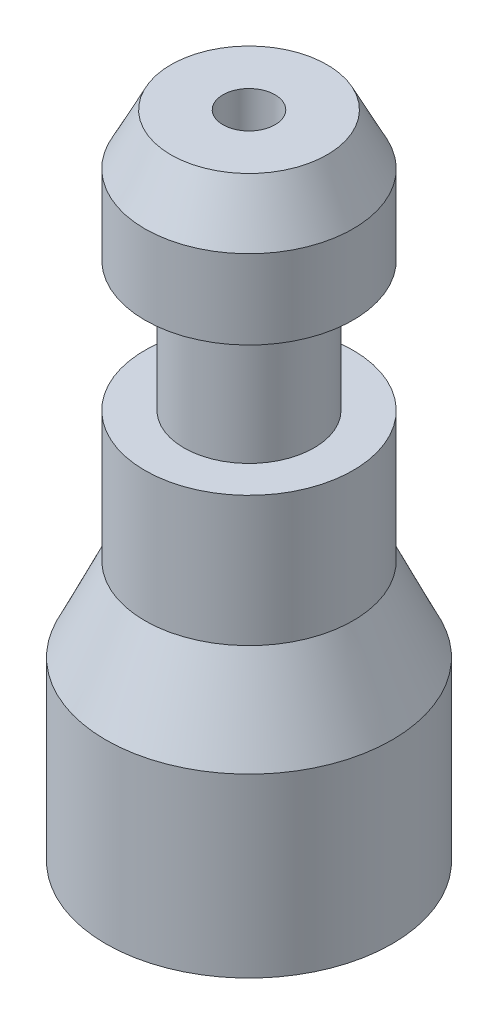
from build123d import *


with BuildPart() as part:
    # Sketch1 → Revolve1 (revolve)
    with BuildSketch(Plane(origin=(0, 0, 0), x_dir=(0, 0, -1), z_dir=(1, 0, 0)), mode=Mode.PRIVATE) as revolve1_sk:
        Polygon((0, 0), (11, 0), (11, 13.57), (8, 20), (8, 30), (5, 30), (5, 40), (8, 40), (8, 46.075607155), (6, 50), (2, 50), (2, 5.82), (0, 5.82), align=None)
    revolve(revolve1_sk.sketch.rotate(Axis((0, 5.82, 0), (0, -1, 0)), 180), axis=Axis((0, 5.82, 0), (0, -1, 0)))


solid = part.part
